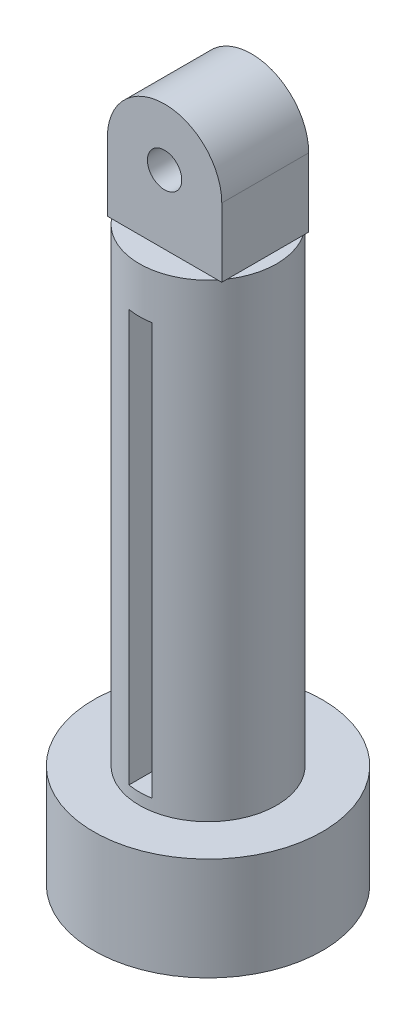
from build123d import *

# Parameters (mm, degrees)
SKETCH_1_W               = 10
SKETCH_1_H               = 11
EXTRUDE_1_DEPTH          = 8
SKETCH_2_R               = 1.5
CUT_EXTRUDE_1_DEPTH      = 37.28474689
SKETCH_3_R               = 6
EXTRUDE_2_DEPTH          = 45
SKETCH_4_R               = 3.25
CUT_EXTRUDE_2_DEPTH      = 41
CUT_EXTRUDE_3_DEPTH      = 15
CUT_EXTRUDE_3_DEPTH_BACK = 21
EXTRUDE_START            = -4
SKETCH_4_3_R             = 10
SKETCH_4_3_R_2           = 6
EXTRUDE_3_DEPTH          = 4
SKETCH_6_R               = 10
SKETCH_6_R_2             = 8
EXTRUDE_4_DEPTH          = 5
CUT_EXTRUDE_4_DEPTH      = 0.2
CUT_EXTRUDE_START        = -0.2
CUT_EXTRUDE_5_DEPTH      = 0.2


with BuildPart() as part:
    # Sketch 1 → Extrude 1 (new body)
    with BuildSketch(Plane.XY):
        with Locations((-18.383084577, 21.067164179)):
            Rectangle(SKETCH_1_W, SKETCH_1_H)
    extrude(amount=EXTRUDE_1_DEPTH)

    # Sketch 2 → Cut-Extrude 1 (cut, through all)
    with BuildSketch(Plane.XY.offset(8)):
        with BuildLine():
            Line((-18.383084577, 26.567164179), (-23.383084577, 26.567164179))
            Line((-23.383084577, 26.567164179), (-23.383084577, 21.567164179))
            ThreePointArc((-23.383084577, 21.567164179), (-21.918618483, 25.102698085), (-18.383084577, 26.567164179))
        make_face()
        with BuildLine():
            Line((-13.383084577, 26.567164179), (-18.383084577, 26.567164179))
            ThreePointArc((-18.383084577, 26.567164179), (-14.847550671, 25.102698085), (-13.383084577, 21.567164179))
            Line((-13.383084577, 21.567164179), (-13.383084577, 26.567164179))
        make_face()
        with Locations((-18.383084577, 21.567164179)):
            Circle(SKETCH_2_R)
    extrude(amount=-CUT_EXTRUDE_1_DEPTH, mode=Mode.SUBTRACT)

    # Sketch 3 → Extrude 2 (add)
    with BuildSketch(Plane.XZ.offset(-15.567164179)):
        with Locations(Location((-18.383084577, 4, 0), (0, 0, 41.810314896))):
            Circle(SKETCH_3_R)
    extrude(amount=EXTRUDE_2_DEPTH)

    # Sketch 4 → Cut-Extrude 2 (cut)
    with BuildSketch(Plane.XZ.offset(29.432835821)):
        with Locations(Location((-18.383084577, 4, 0), (0, 0, 270))):
            Circle(SKETCH_4_R)
    extrude(amount=-CUT_EXTRUDE_2_DEPTH, mode=Mode.SUBTRACT)

    # Sketch 5 → Cut-Extrude 3 (cut, two sides: drawn at the far end of the back side and taken through both)
    with BuildSketch(Plane(origin=(0, -9.432835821, 0), x_dir=(-1, 0, 0), z_dir=(0, -1, 0)).offset(-CUT_EXTRUDE_3_DEPTH_BACK)):
        with BuildLine():
            Line((18.383084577, -0.75), (18.383084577, 2))
            ThreePointArc((18.383084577, 2), (17.881327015, 1.978983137), (17.383084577, 1.916079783))
            Line((17.383084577, 1.916079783), (17.383084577, -0.907670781))
            ThreePointArc((17.383084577, -0.907670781), (17.876907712, -0.789659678), (18.383084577, -0.75))
        make_face()
        with BuildLine():
            Line((18.383084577, -10), (18.383084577, -7.25))
            ThreePointArc((18.383084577, -7.25), (17.876907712, -7.210340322), (17.383084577, -7.092329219))
            Line((17.383084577, -7.092329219), (17.383084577, -9.916079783))
            ThreePointArc((17.383084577, -9.916079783), (17.881327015, -9.978983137), (18.383084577, -10))
        make_face()
        with BuildLine():
            ThreePointArc((19.383084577, 1.916079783), (18.884842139, 1.978983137), (18.383084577, 2))
            Line((18.383084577, 2), (18.383084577, -0.75))
            ThreePointArc((18.383084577, -0.75), (18.889261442, -0.789659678), (19.383084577, -0.907670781))
            Line((19.383084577, -0.907670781), (19.383084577, 1.916079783))
        make_face()
        with BuildLine():
            ThreePointArc((19.383084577, -7.092329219), (18.889261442, -7.210340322), (18.383084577, -7.25))
            Line((18.383084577, -7.25), (18.383084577, -10))
            ThreePointArc((18.383084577, -10), (18.884842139, -9.978983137), (19.383084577, -9.916079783))
            Line((19.383084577, -9.916079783), (19.383084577, -7.092329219))
        make_face()
        with BuildLine():
            ThreePointArc((19.383084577, 1.916079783), (18.884842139, 1.978983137), (18.383084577, 2))
            Line((18.383084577, 2), (18.383084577, -0.75))
            ThreePointArc((18.383084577, -0.75), (18.889261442, -0.789659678), (19.383084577, -0.907670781))
            Line((19.383084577, -0.907670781), (19.383084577, 1.916079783))
        make_face()
        with BuildLine():
            ThreePointArc((19.383084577, -7.092329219), (18.889261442, -7.210340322), (18.383084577, -7.25))
            Line((18.383084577, -7.25), (18.383084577, -10))
            ThreePointArc((18.383084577, -10), (18.884842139, -9.978983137), (19.383084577, -9.916079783))
            Line((19.383084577, -9.916079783), (19.383084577, -7.092329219))
        make_face()
        with BuildLine():
            Line((18.383084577, -0.75), (18.383084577, 2))
            ThreePointArc((18.383084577, 2), (17.881327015, 1.978983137), (17.383084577, 1.916079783))
            Line((17.383084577, 1.916079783), (17.383084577, -0.907670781))
            ThreePointArc((17.383084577, -0.907670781), (17.876907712, -0.789659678), (18.383084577, -0.75))
        make_face()
        with BuildLine():
            Line((18.383084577, -10), (18.383084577, -7.25))
            ThreePointArc((18.383084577, -7.25), (17.876907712, -7.210340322), (17.383084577, -7.092329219))
            Line((17.383084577, -7.092329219), (17.383084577, -9.916079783))
            ThreePointArc((17.383084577, -9.916079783), (17.881327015, -9.978983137), (18.383084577, -10))
        make_face()
    extrude(amount=CUT_EXTRUDE_3_DEPTH + CUT_EXTRUDE_3_DEPTH_BACK, mode=Mode.SUBTRACT)

    # Sketch 4_3 → Extrude 3 (add)
    with BuildSketch(Plane.XZ.offset(29.432835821).offset(EXTRUDE_START)):
        with Locations(Location((-18.383084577, 4, 0), (0, 0, 270))):
            Circle(SKETCH_4_3_R)
        with Locations(Location((-18.383084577, 4, 0), (0, 0, 41.810314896))):
            Circle(SKETCH_4_3_R_2, mode=Mode.SUBTRACT)
    extrude(amount=EXTRUDE_3_DEPTH)

    # Sketch 6 → Extrude 4 (add)
    with BuildSketch(Plane.XZ.offset(29.432835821)):
        with Locations(Location((-18.383084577, 4, 0), (0, 0, 270))):
            Circle(SKETCH_6_R)
        with Locations(Location((-18.383084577, 4, 0), (0, 0, 270))):
            Circle(SKETCH_6_R_2, mode=Mode.SUBTRACT)
    extrude(amount=EXTRUDE_4_DEPTH)

    # Sketch 9 → Cut-Extrude 4 (cut)
    with BuildSketch(Plane.XY.offset(8)):
        with BuildLine():
            Line((-13.383084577, 15.567164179), (-13.383084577, 21.567164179))
            ThreePointArc((-13.383084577, 21.567164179), (-18.383084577, 26.567164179), (-23.383084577, 21.567164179))
            Line((-23.383084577, 21.567164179), (-23.383084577, 15.567164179))
            Line((-23.383084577, 15.567164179), (-22.855220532, 15.567164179))
            Line((-22.855220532, 15.567164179), (-13.910948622, 15.567164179))
            Line((-13.910948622, 15.567164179), (-13.383084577, 15.567164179))
        make_face()
    extrude(amount=-CUT_EXTRUDE_4_DEPTH, mode=Mode.SUBTRACT)

    # Sketch 11 → Cut-Extrude 5 (cut)
    with BuildSketch(Plane(origin=(0, 0, 0), x_dir=(-1, 0, 0), z_dir=(0, 0, -1)).offset(CUT_EXTRUDE_START)):
        with BuildLine():
            Line((13.383084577, 21.567164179), (13.383084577, 15.567164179))
            Line((13.383084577, 15.567164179), (13.910948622, 15.567164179))
            Line((13.910948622, 15.567164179), (22.855220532, 15.567164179))
            Line((22.855220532, 15.567164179), (23.383084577, 15.567164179))
            Line((23.383084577, 15.567164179), (23.383084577, 21.567164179))
            ThreePointArc((23.383084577, 21.567164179), (18.383084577, 26.567164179), (13.383084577, 21.567164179))
        make_face()
    extrude(amount=CUT_EXTRUDE_5_DEPTH, mode=Mode.SUBTRACT)


solid = part.part
